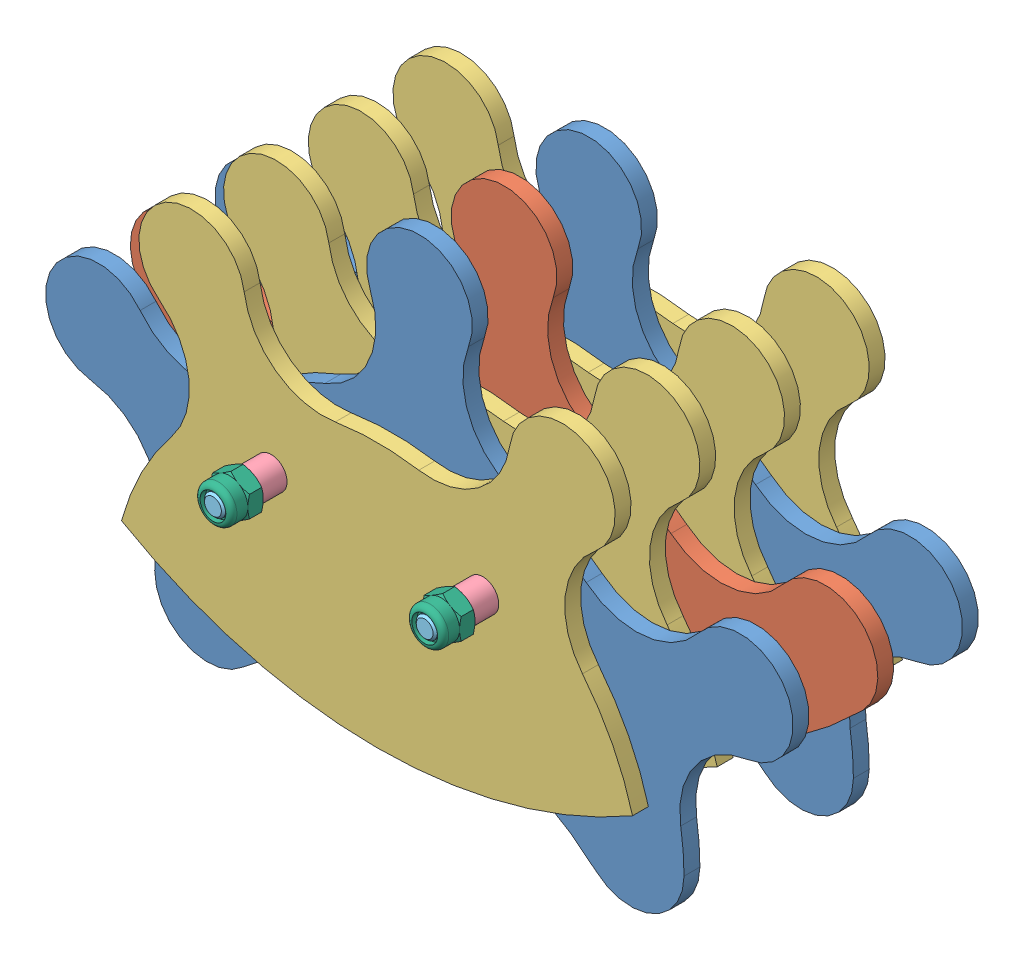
SolidWorks assembly Hedgehog.SLDASM, configuration Default (file format 4100). Lengths in mm.
Overall size (141.24 90 68).
27 component instances, 6 part files, 57 mates.
Components (placement in the parent):
- 3-Spike-Legs-1: 3-Spike-Legs.SLDPRT [Default] at (13.4982 -25.3927 10.1286) size (141.24 90 3)
- 3-Spike-Legs-2: 3-Spike-Legs.SLDPRT [Default] at (13.4982 -25.3927 -21.8714) size (141.24 90 3)
- 3-Spike-1: 3-Spike.SLDPRT [Default] at (13.4982 -25.3927 -5.8714) size (141.24 80 3)
- 2-Spike-1: 2-Spike.SLDPRT [Default] at (13.4982 -25.3927 18.1286) size (96.55 70.62 3)
- 2-Spike-2: 2-Spike.SLDPRT [Default] at (13.4982 -25.3927 2.1286) size (96.55 70.62 3)
- 2-Spike-3: 2-Spike.SLDPRT [Default] at (13.4982 -25.3927 -13.8714) size (96.55 70.62 3)
- 2-Spike-4: 2-Spike.SLDPRT [Default] at (13.4982 -25.3927 -29.8714) size (96.55 70.62 3)
- Spacer-1: Spacer.SLDPRT [Default] at (33.4982 9.6073 21.1286) x (0.350651 -0.936506 0) z (0 0 1) size (6 6 5)
- Spacer-2: Spacer.SLDPRT [Default] at (-6.5018 9.6073 21.1286) x (0.562357 -0.826895 0) z (0 0 1) size (6 6 5)
- Spacer-3: Spacer.SLDPRT [Default] at (-6.5018 9.6073 13.1286) x (0.150095 -0.988672 0) z (0 0 1) size (6 6 5)
- Spacer-4: Spacer.SLDPRT [Default] at (33.4982 9.6073 13.1286) x (0.3461 -0.938198 0) z (0 0 1) size (6 6 5)
- Spacer-5: Spacer.SLDPRT [Default] at (-6.5018 9.6073 5.1286) size (6 6 5)
- Spacer-6: Spacer.SLDPRT [Default] at (33.4982 9.6073 5.1286) x (-0.225253 -0.9743 0) z (0 0 1) size (6 6 5)
- Spacer-7: Spacer.SLDPRT [Default] at (-6.5018 9.6073 -2.8714) size (6 6 5)
- Spacer-8: Spacer.SLDPRT [Default] at (33.4982 9.6073 -2.8714) size (6 6 5)
- Spacer-9: Spacer.SLDPRT [Default] at (-6.5018 9.6073 -10.8714) size (6 6 5)
- Spacer-10: Spacer.SLDPRT [Default] at (33.4982 9.6073 -10.8714) x (0.829354 -0.558724 0) z (0 0 1) size (6 6 5)
- Spacer-11: Spacer.SLDPRT [Default] at (-6.5018 9.6073 -18.8714) size (6 6 5)
- Spacer-12: Spacer.SLDPRT [Default] at (33.4982 9.6073 -18.8714) size (6 6 5)
- Spacer-13: Spacer.SLDPRT [Default] at (-6.5018 9.6073 -26.8714) x (0.813242 -0.581926 0) z (0 0 1) size (6 6 5)
- Spacer-14: Spacer.SLDPRT [Default] at (33.4982 9.6073 -26.8714) x (0.323042 -0.946385 0) z (0 0 1) size (6 6 5)
- M4x68ThreadedBar-1: M4x68ThreadedBar.SLDPRT [Default] at (-6.5018 9.6073 32.1286) x (1 0 0) z (0 1 0) size (4 68 4)
- M4x68ThreadedBar-2: M4x68ThreadedBar.SLDPRT [Default] at (33.4982 9.6073 32.1286) x (1 0 0) z (0 1 0) size (4 68 4)
- M4NylonLockNut-1: M4NylonLockNut.SLDPRT [M4NylonLockNut] at (-6.5018 9.6073 29.0286) size (7 8.08 6)
- M4NylonLockNut-2: M4NylonLockNut.SLDPRT [M4NylonLockNut] at (33.4982 9.6073 29.0286) size (7 8.08 6)
- M4NylonLockNut-4: M4NylonLockNut.SLDPRT [M4NylonLockNut] at (33.4982 9.6073 -32.7714) x (0.923728 0.383049 0) z (0 0 -1) size (7 8.08 6)
- M4NylonLockNut-5: M4NylonLockNut.SLDPRT [M4NylonLockNut] at (-6.5018 9.6073 -32.7714) x (0.923728 0.383049 0) z (0 0 -1) size (7 8.08 6)
Mates (geometry in assembly coordinates):
- Concentric1: concentric aligned: cylinder of 3-Spike-Legs-1 through (33.4982 9.6073 13.1286) axis (0 0 -1) radius 2; cylinder of 2-Spike-1 through (33.4982 9.6073 21.1286) axis (0 0 -1) radius 2
- Concentric2: concentric aligned: cylinder of 3-Spike-Legs-1 through (33.4982 9.6073 13.1286) axis (0 0 -1) radius 2; cylinder of 2-Spike-2 through (33.4982 9.6073 5.1286) axis (0 0 -1) radius 2
- Concentric3: concentric aligned: cylinder of 3-Spike-1 through (33.4982 9.6073 -2.8714) axis (0 0 -1) radius 2; cylinder of 2-Spike-2 through (33.4982 9.6073 5.1286) axis (0 0 -1) radius 2
- Concentric4: concentric aligned: cylinder of 3-Spike-1 through (33.4982 9.6073 -2.8714) axis (0 0 -1) radius 2; cylinder of 2-Spike-3 through (33.4982 9.6073 -10.8714) axis (0 0 -1) radius 2
- Concentric5: concentric aligned: cylinder of 3-Spike-Legs-2 through (33.4982 9.6073 -18.8714) axis (0 0 -1) radius 2; cylinder of 2-Spike-3 through (33.4982 9.6073 -10.8714) axis (0 0 -1) radius 2
- Concentric6: concentric aligned: cylinder of 3-Spike-Legs-2 through (33.4982 9.6073 -18.8714) axis (0 0 -1) radius 2; cylinder of 2-Spike-4 through (33.4982 9.6073 -26.8714) axis (0 0 -1) radius 2
- Concentric7: concentric aligned: cylinder of 3-Spike-Legs-2 through (-6.5018 9.6073 -18.8714) axis (0 0 -1) radius 2; cylinder of 2-Spike-4 through (-6.5018 9.6073 -26.8714) axis (0 0 -1) radius 2
- Concentric8: concentric aligned: cylinder of 3-Spike-Legs-2 through (-6.5018 9.6073 -18.8714) axis (0 0 -1) radius 2; cylinder of 2-Spike-3 through (-6.5018 9.6073 -10.8714) axis (0 0 -1) radius 2
- Concentric9: concentric aligned: cylinder of 2-Spike-2 through (-6.5018 9.6073 5.1286) axis (0 0 -1) radius 2; cylinder of 2-Spike-3 through (-6.5018 9.6073 -10.8714) axis (0 0 -1) radius 2
- Concentric10: concentric aligned: cylinder of 3-Spike-Legs-1 through (-6.5018 9.6073 13.1286) axis (0 0 -1) radius 2; cylinder of 2-Spike-2 through (-6.5018 9.6073 5.1286) axis (0 0 -1) radius 2
- Concentric11: concentric aligned: cylinder of 3-Spike-Legs-1 through (-6.5018 9.6073 13.1286) axis (0 0 -1) radius 2; cylinder of 2-Spike-1 through (-6.5018 9.6073 21.1286) axis (0 0 -1) radius 2
- Concentric12: concentric aligned: cylinder of 2-Spike-1 through (33.4982 9.6073 21.1286) axis (0 0 -1) radius 2; cylinder of Spacer-1 through (33.4982 9.6073 26.1286) axis (0 0 -1) radius 2
- Concentric13: concentric aligned: cylinder of 2-Spike-1 through (-6.5018 9.6073 21.1286) axis (0 0 -1) radius 2; cylinder of Spacer-2 through (-6.5018 9.6073 26.1286) axis (0 0 -1) radius 2
- Concentric14: concentric aligned: cylinder of 3-Spike-Legs-1 through (33.4982 9.6073 13.1286) axis (0 0 -1) radius 2; cylinder of Spacer-4 through (33.4982 9.6073 18.1286) axis (0 0 -1) radius 2
- Concentric15: concentric aligned: cylinder of 3-Spike-Legs-1 through (-6.5018 9.6073 13.1286) axis (0 0 -1) radius 2; cylinder of Spacer-3 through (-6.5018 9.6073 18.1286) axis (0 0 -1) radius 2
- Concentric16: concentric aligned: cylinder of 2-Spike-2 through (33.4982 9.6073 5.1286) axis (0 0 -1) radius 2; cylinder of Spacer-6 through (33.4982 9.6073 10.1286) axis (0 0 -1) radius 2
- Concentric17: concentric aligned: cylinder of 2-Spike-2 through (-6.5018 9.6073 5.1286) axis (0 0 -1) radius 2; cylinder of Spacer-5 through (-6.5018 9.6073 10.1286) axis (0 0 -1) radius 2
- Concentric18: concentric aligned: cylinder of 3-Spike-1 through (33.4982 9.6073 -2.8714) axis (0 0 -1) radius 2; cylinder of Spacer-8 through (33.4982 9.6073 2.1286) axis (0 0 -1) radius 2
- Concentric19: concentric aligned: cylinder of 3-Spike-1 through (-6.5018 9.6073 -2.8714) axis (0 0 -1) radius 2; cylinder of Spacer-7 through (-6.5018 9.6073 2.1286) axis (0 0 -1) radius 2
- Concentric20: concentric aligned: cylinder of 2-Spike-4 through (33.4982 9.6073 -26.8714) axis (0 0 -1) radius 2; cylinder of Spacer-14 through (33.4982 9.6073 -21.8714) axis (0 0 -1) radius 2
- Concentric21: concentric aligned: cylinder of 2-Spike-4 through (-6.5018 9.6073 -26.8714) axis (0 0 -1) radius 2; cylinder of Spacer-13 through (-6.5018 9.6073 -21.8714) axis (0 0 -1) radius 2
- Concentric22: concentric aligned: cylinder of 3-Spike-Legs-2 through (33.4982 9.6073 -18.8714) axis (0 0 -1) radius 2; cylinder of Spacer-12 through (33.4982 9.6073 -13.8714) axis (0 0 -1) radius 2
- Concentric23: concentric aligned: cylinder of 3-Spike-Legs-2 through (-6.5018 9.6073 -18.8714) axis (0 0 -1) radius 2; cylinder of Spacer-11 through (-6.5018 9.6073 -13.8714) axis (0 0 -1) radius 2
- Concentric24: concentric aligned: cylinder of 2-Spike-3 through (33.4982 9.6073 -10.8714) axis (0 0 -1) radius 2; cylinder of Spacer-10 through (33.4982 9.6073 -5.8714) axis (0 0 -1) radius 2
- Concentric25: concentric aligned: cylinder of 3-Spike-1 through (-6.5018 9.6073 -2.8714) axis (0 0 -1) radius 2; cylinder of Spacer-9 through (-6.5018 9.6073 -5.8714) axis (0 0 -1) radius 2
- Coincident1: coincident anti-aligned: plane of 2-Spike-4 through (-29.2313 25.4053 -26.8714) normal (0 0 1); plane of Spacer-14 through (33.4982 9.6073 -26.8714) normal (0 0 -1)
- Coincident2: coincident anti-aligned: plane of 2-Spike-4 through (-29.2313 25.4053 -26.8714) normal (0 0 1); plane of Spacer-13 through (-6.5018 9.6073 -26.8714) normal (0 0 -1)
- Coincident3: coincident anti-aligned: plane of 3-Spike-Legs-2 through (-6.5018 -47.7534 -21.8714) normal (0 0 -1); plane of Spacer-14 through (33.4982 9.6073 -21.8714) normal (0 0 1)
- Coincident4: coincident anti-aligned: plane of 3-Spike-Legs-2 through (-6.5018 -47.7534 -18.8714) normal (0 0 1); plane of Spacer-12 through (33.4982 9.6073 -18.8714) normal (0 0 -1)
- Coincident5: coincident anti-aligned: plane of 3-Spike-Legs-2 through (-6.5018 -47.7534 -18.8714) normal (0 0 1); plane of Spacer-11 through (-6.5018 9.6073 -18.8714) normal (0 0 -1)
- Coincident6: coincident anti-aligned: plane of 2-Spike-3 through (-29.2313 25.4053 -13.8714) normal (0 0 -1); plane of Spacer-12 through (33.4982 9.6073 -13.8714) normal (0 0 1)
- Coincident7: coincident anti-aligned: plane of 2-Spike-3 through (-29.2313 25.4053 -10.8714) normal (0 0 1); plane of Spacer-10 through (33.4982 9.6073 -10.8714) normal (0 0 -1)
- Coincident8: coincident anti-aligned: plane of 2-Spike-3 through (-29.2313 25.4053 -10.8714) normal (0 0 1); plane of Spacer-9 through (-6.5018 9.6073 -10.8714) normal (0 0 -1)
- Coincident9: coincident anti-aligned: plane of 3-Spike-1 through (-16.8127 40.1073 -5.8714) normal (0 0 -1); plane of Spacer-10 through (33.4982 9.6073 -5.8714) normal (0 0 1)
- Coincident10: coincident anti-aligned: plane of 3-Spike-1 through (-16.8127 40.1073 -2.8714) normal (0 0 1); plane of Spacer-8 through (33.4982 9.6073 -2.8714) normal (0 0 -1)
- Coincident11: coincident anti-aligned: plane of 3-Spike-1 through (-16.8127 40.1073 -2.8714) normal (0 0 1); plane of Spacer-7 through (-6.5018 9.6073 -2.8714) normal (0 0 -1)
- Coincident12: coincident anti-aligned: plane of 2-Spike-2 through (-29.2313 25.4053 2.1286) normal (0 0 -1); plane of Spacer-8 through (33.4982 9.6073 2.1286) normal (0 0 1)
- Coincident13: coincident anti-aligned: plane of 2-Spike-2 through (-29.2313 25.4053 5.1286) normal (0 0 1); plane of Spacer-5 through (-6.5018 9.6073 5.1286) normal (0 0 -1)
- Coincident14: coincident anti-aligned: plane of 2-Spike-2 through (-29.2313 25.4053 5.1286) normal (0 0 1); plane of Spacer-6 through (33.4982 9.6073 5.1286) normal (0 0 -1)
- Coincident16: coincident anti-aligned: plane of 3-Spike-Legs-1 through (-6.5018 -47.7534 10.1286) normal (0 0 -1); plane of Spacer-6 through (33.4982 9.6073 10.1286) normal (0 0 1)
- Coincident17: coincident anti-aligned: plane of 3-Spike-Legs-1 through (-6.5018 -47.7534 13.1286) normal (0 0 1); plane of Spacer-4 through (33.4982 9.6073 13.1286) normal (0 0 -1)
- Coincident18: coincident anti-aligned: plane of 3-Spike-Legs-1 through (-6.5018 -47.7534 13.1286) normal (0 0 1); plane of Spacer-3 through (-6.5018 9.6073 13.1286) normal (0 0 -1)
- Coincident19: coincident anti-aligned: plane of 2-Spike-1 through (-29.2313 25.4053 18.1286) normal (0 0 -1); plane of Spacer-4 through (33.4982 9.6073 18.1286) normal (0 0 1)
- Coincident20: coincident anti-aligned: plane of 2-Spike-1 through (-29.2313 25.4053 21.1286) normal (0 0 1); plane of Spacer-1 through (33.4982 9.6073 21.1286) normal (0 0 -1)
- Coincident21: coincident anti-aligned: plane of 2-Spike-1 through (-29.2313 25.4053 21.1286) normal (0 0 1); plane of Spacer-2 through (-6.5018 9.6073 21.1286) normal (0 0 -1)
- Concentric26: concentric anti-aligned: cylinder of Spacer-1 through (33.4982 9.6073 26.1286) axis (0 0 -1) radius 2; cylinder of M4x68ThreadedBar-2 through (33.4982 9.6073 -35.8714) axis (0 0 1) radius 2
- Concentric27: concentric anti-aligned: cylinder of Spacer-2 through (-6.5018 9.6073 26.1286) axis (0 0 -1) radius 2; cylinder of M4x68ThreadedBar-1 through (-6.5018 9.6073 -35.8714) axis (0 0 1) radius 2
- Distance1: distance = 6 mm aligned: plane of M4x68ThreadedBar-2 through (33.4982 9.6073 -35.8714) normal (0 0 -1); plane of 2-Spike-4 through (-29.2313 25.4053 -29.8714) normal (0 0 -1)
- Distance2: distance = 6 mm aligned: plane of M4x68ThreadedBar-1 through (-6.5018 9.6073 -35.8714) normal (0 0 -1); plane of 2-Spike-4 through (-29.2313 25.4053 -29.8714) normal (0 0 -1)
- Concentric281: concentric anti-aligned: cylinder of Spacer-2 through (-6.5018 9.6073 26.1286) axis (0 0 -1) radius 2; cylinder of M4NylonLockNut-1 through (-6.5018 9.6073 3.9911) axis (0 0 1) radius 2
- Coincident241: coincident anti-aligned: plane of Spacer-2 through (-6.5018 9.6073 26.1286) normal (0 0 1); plane of M4NylonLockNut-1 through (-6.5018 13.6487 26.1286) normal (0 0 -1)
- Concentric291: concentric anti-aligned: cylinder of Spacer-1 through (33.4982 9.6073 26.1286) axis (0 0 -1) radius 2; cylinder of M4NylonLockNut-2 through (33.4982 9.6073 3.9911) axis (0 0 1) radius 2
- Coincident251: coincident anti-aligned: plane of Spacer-1 through (33.4982 9.6073 26.1286) normal (0 0 1); plane of M4NylonLockNut-2 through (33.4982 13.6487 26.1286) normal (0 0 -1)
- Concentric301: concentric aligned: cylinder of 2-Spike-4 through (33.4982 9.6073 -26.8714) axis (0 0 -1) radius 2; cylinder of M4NylonLockNut-4 through (33.4982 9.6073 -7.7339) axis (0 0 -1) radius 2
- Coincident261: coincident anti-aligned: plane of 2-Spike-4 through (-29.2313 25.4053 -29.8714) normal (0 0 -1); plane of M4NylonLockNut-4 through (35.0463 5.8741 -29.8714) normal (0 0 1)
- Concentric311: concentric aligned: cylinder of 2-Spike-4 through (-6.5018 9.6073 -26.8714) axis (0 0 -1) radius 2; cylinder of M4NylonLockNut-5 through (-6.5018 9.6073 -7.7339) axis (0 0 -1) radius 2
- Coincident271: coincident anti-aligned: plane of 2-Spike-4 through (-29.2313 25.4053 -29.8714) normal (0 0 -1); plane of M4NylonLockNut-5 through (-4.9537 5.8741 -29.8714) normal (0 0 1)
